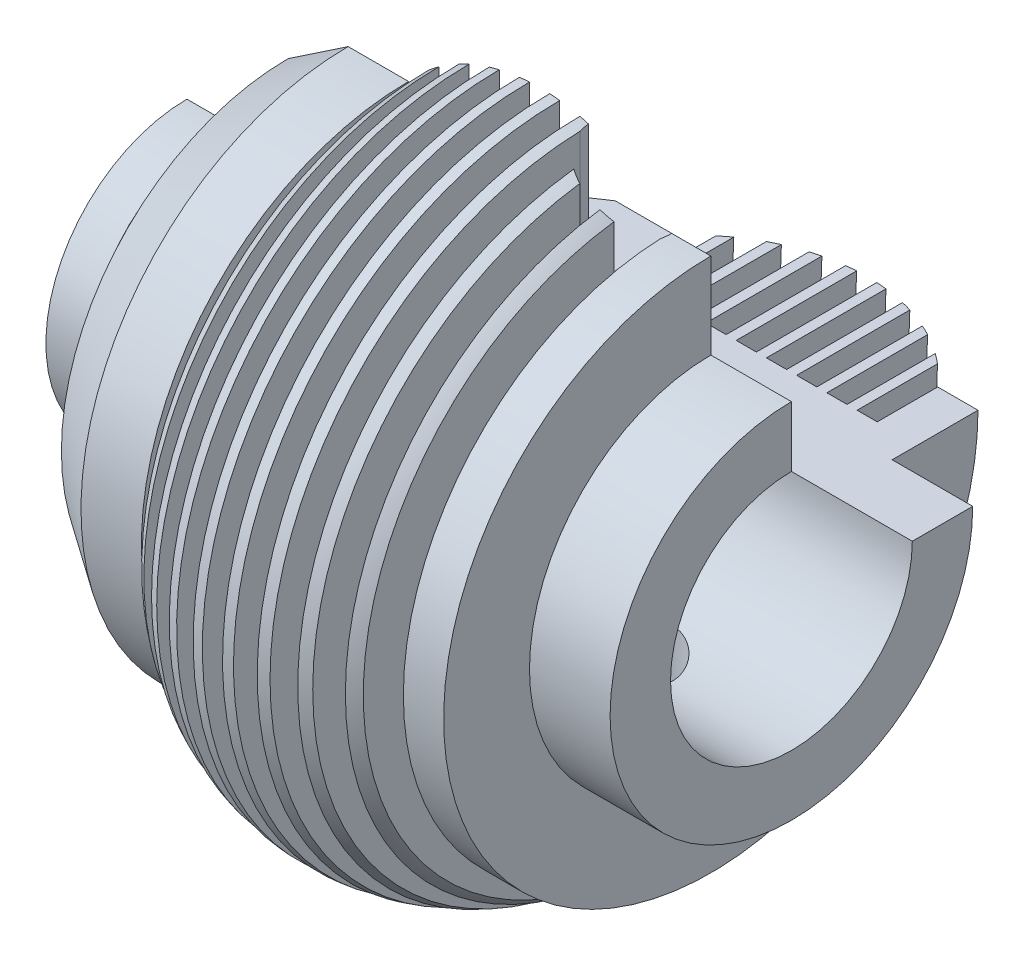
from build123d import *

# Parameters (mm, degrees)
REVOLUCI_N2_ANGLE     = 270
CROQUIS12_R           = 10.307991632
CORTAR_EXTRUIR1_DEPTH = 147.509045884
CROQUIS12_2_R         = 10.307991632
CORTAR_EXTRUIR2_DEPTH = 147.509045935


with BuildPart() as part:
    # Croquis2 → Revoluci_n2 (revolve)
    with BuildSketch(Plane.XY):
        with BuildLine():
            Line((-25, 0), (-25, 15))
            Line((-25, 15), (75, 15))
            Line((75, 15), (75, 30))
            Line((75, 30), (55, 30))
            Line((55, 30), (55, 51.3))
            Line((55, 51.3), (45, 51.3))
            Line((45, 51.3), (45, 36.3))
            Line((45, 36.3), (40, 36.3))
            Line((40, 36.3), (40, 56.246772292))
            ThreePointArc((40, 56.246772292), (38.76797888, 57.241607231), (37.5, 58.19018625))
            Line((37.5, 58.19018625), (37.5, 36.3))
            Line((37.5, 36.3), (32.5, 36.3))
            Line((32.5, 36.3), (32.5, 61.290245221))
            ThreePointArc((32.5, 61.290245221), (31.259906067, 61.920128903), (30, 62.509385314))
            Line((30, 62.509385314), (30, 36.3))
            Line((30, 36.3), (25, 36.3))
            Line((25, 36.3), (25, 64.384554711))
            ThreePointArc((25, 64.384554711), (23.755157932, 64.744183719), (22.5, 65.065965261))
            Line((22.5, 65.065965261), (22.5, 36.3))
            Line((22.5, 36.3), (17.5, 36.3))
            Line((17.5, 36.3), (17.5, 65.957524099))
            ThreePointArc((17.5, 65.957524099), (16.251612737, 66.085843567), (15, 66.177507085))
            Line((15, 66.177507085), (15, 36.3))
            Line((15, 36.3), (10, 36.3))
            Line((10, 36.3), (10, 66.177507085))
            ThreePointArc((10, 66.177507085), (8.748387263, 66.085843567), (7.5, 65.957524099))
            Line((7.5, 65.957524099), (7.5, 36.3))
            Line((7.5, 36.3), (2.5, 36.3))
            Line((2.5, 36.3), (2.5, 65.065965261))
            ThreePointArc((2.5, 65.065965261), (1.244842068, 64.744183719), (0, 64.384554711))
            Line((0, 64.384554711), (0, 36.3))
            Line((0, 36.3), (-5, 36.3))
            Line((-5, 36.3), (-5, 62.509385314))
            ThreePointArc((-5, 62.509385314), (-6.259906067, 61.920128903), (-7.5, 61.290245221))
            Line((-7.5, 61.290245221), (-7.5, 36.3))
            Line((-7.5, 36.3), (-12.5, 36.3))
            Line((-12.5, 36.3), (-12.5, 58.19018625))
            ThreePointArc((-12.5, 58.19018625), (-13.76797888, 57.241607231), (-15, 56.246772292))
            Line((-15, 56.246772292), (-15, 36.3))
            Line((-15, 36.3), (-20, 36.3))
            Line((-20, 36.3), (-20, 51.3))
            Line((-20, 51.3), (-35, 51.3))
            Line((-35, 51.3), (-49.922676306, 41.234527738))
            Line((-49.922676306, 41.234527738), (-49.922676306, 20))
            ThreePointArc((-49.922676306, 20), (-52.851608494, 12.928932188), (-59.922676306, 10))
            Line((-59.922676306, 10), (-65, 10))
            Line((-65, 10), (-65, 20))
            Line((-65, 20), (-75, 20))
            Line((-75, 20), (-75, 0))
            Line((-75, 0), (-25, 0))
        make_face()
    revolve(axis=Axis((-75, -15, 0), (1, 0, 0)), revolution_arc=REVOLUCI_N2_ANGLE)

    # Croquis12 → Cortar-Extruir1 (cut, through all)
    with BuildSketch(Plane(origin=(0, 0, 0), x_dir=(1, 0, 0), z_dir=(0, 1, 0))):
        with Locations((35, 0)):
            Circle(CROQUIS12_R)
    extrude(amount=CORTAR_EXTRUIR1_DEPTH, mode=Mode.SUBTRACT)

    # Croquis12_2 → Cortar-Extruir2 (cut, through all)
    with BuildSketch(Plane(origin=(0, 0, 0), x_dir=(1, 0, 0), z_dir=(0, 1, 0))):
        with Locations(Location((35, 0, 0), (0, 0, 270))):
            Circle(CROQUIS12_2_R)
    extrude(amount=-CORTAR_EXTRUIR2_DEPTH, mode=Mode.SUBTRACT)


solid = part.part
